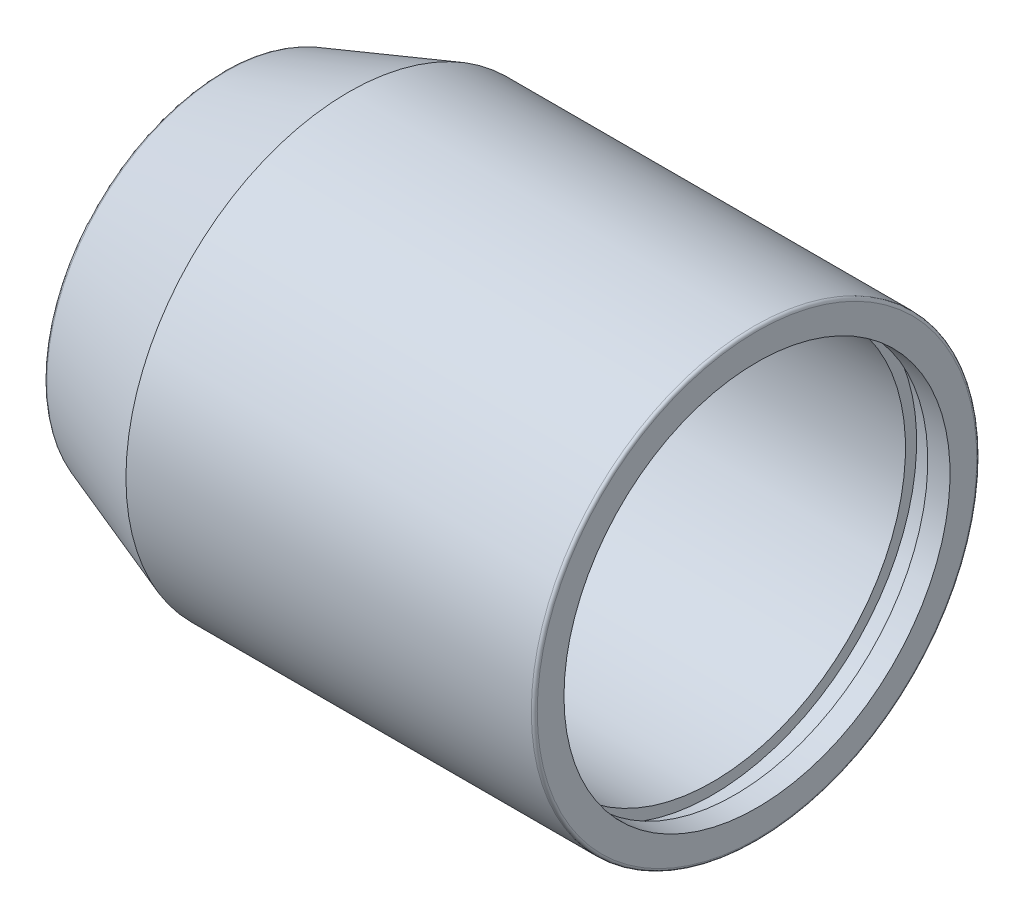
from build123d import *

# Parameters (mm, degrees)
CONG_2_R = 0.4
CONG_3_R = 0.2


with BuildPart() as part:
    # Esquisse1 → Base-R_volution (revolve)
    with BuildSketch(Plane(origin=(0, 0, 0), x_dir=(1, 0, 0), z_dir=(0, 1, 0))):
        Polygon((36, -15), (8.5, -15), (0, -12), (0, -9.5), (4.5, -11), (6.5, -13), (12.5, -13), (12.5, -11.5), (14, -11.5), (14, -13), (33, -13), (33, -13.75), (34.5, -13.75), (34.5, -13), (36, -13), align=None)
    revolve(axis=Axis((-15.5, 0, 0), (1, 0, 0)))

    # Cong_2
    cong_2_edges = [part.edges().sort_by_distance(p)[0] for p in [
        (0, 0, -12),
    ]]
    fillet(cong_2_edges, radius=CONG_2_R)

    # Cong_3
    cong_3_edges = [part.edges().sort_by_distance(p)[0] for p in [
        (36, 0, -15),
    ]]
    fillet(cong_3_edges, radius=CONG_3_R)


solid = part.part
